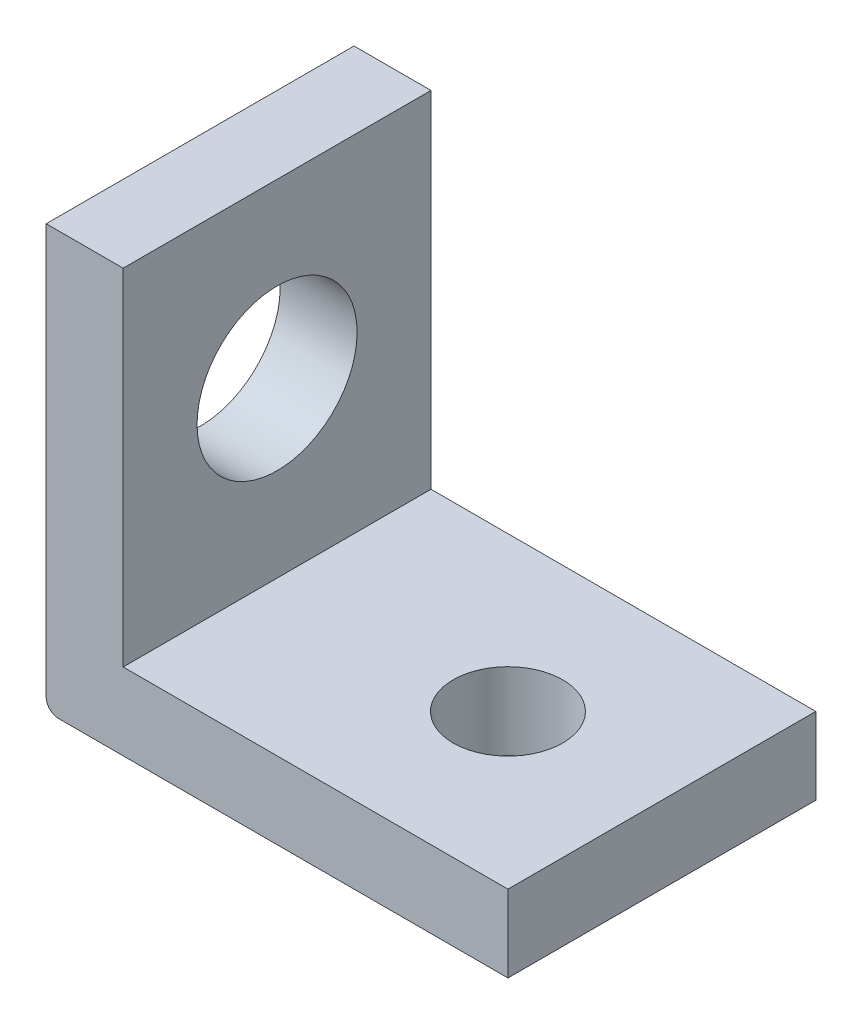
ISO-10303-21;
HEADER;
FILE_DESCRIPTION(('STEP AP214'),'2;1');
FILE_NAME('part.step','',(''),(''),'','','');
FILE_SCHEMA(('AUTOMOTIVE_DESIGN { 1 0 10303 214 1 1 1 1 }'));
ENDSEC;
DATA;
#1=APPLICATION_CONTEXT('core data for automotive mechanical design processes');
#2=APPLICATION_PROTOCOL_DEFINITION('international standard','automotive_design',2000,#1);
#3=PRODUCT_CONTEXT('',#1,'mechanical');
#4=PRODUCT('Part','Part','',(#3));
#5=PRODUCT_RELATED_PRODUCT_CATEGORY('part','',(#4));
#6=PRODUCT_DEFINITION_FORMATION('','',#4);
#7=PRODUCT_DEFINITION_CONTEXT('part definition',#1,'design');
#8=PRODUCT_DEFINITION('design','',#6,#7);
#9=PRODUCT_DEFINITION_SHAPE('','',#8);
#10=(LENGTH_UNIT() NAMED_UNIT(*) SI_UNIT(.MILLI.,.METRE.));
#11=(NAMED_UNIT(*) PLANE_ANGLE_UNIT() SI_UNIT($,.RADIAN.));
#12=(NAMED_UNIT(*) SI_UNIT($,.STERADIAN.) SOLID_ANGLE_UNIT());
#13=UNCERTAINTY_MEASURE_WITH_UNIT(LENGTH_MEASURE(1.E-05),#10,'distance_accuracy_value','');
#14=(GEOMETRIC_REPRESENTATION_CONTEXT(3) GLOBAL_UNCERTAINTY_ASSIGNED_CONTEXT((#13)) GLOBAL_UNIT_ASSIGNED_CONTEXT((#10,
#11,#12)) REPRESENTATION_CONTEXT('',''));
#15=CARTESIAN_POINT('',(0.,0.,0.));
#16=DIRECTION('',(0.,0.,1.));
#17=DIRECTION('',(1.,0.,0.));
#18=AXIS2_PLACEMENT_3D('',#15,#16,#17);
#19=CARTESIAN_POINT('',(0.,7.1247,6.35));
#20=DIRECTION('',(0.,-1.,0.));
#21=DIRECTION('',(1.,0.,0.));
#22=AXIS2_PLACEMENT_3D('',#19,#20,#21);
#23=PLANE('',#22);
#24=DIRECTION('',(-1.,0.,0.));
#25=VECTOR('',#24,1.);
#26=CARTESIAN_POINT('',(0.,7.1247,0.));
#27=LINE('',#26,#25);
#28=CARTESIAN_POINT('',(0.,7.1247,0.));
#29=VERTEX_POINT('',#28);
#30=CARTESIAN_POINT('',(-1.5875,7.1247,0.));
#31=VERTEX_POINT('',#30);
#32=EDGE_CURVE('E126',#29,#31,#27,.T.);
#33=ORIENTED_EDGE('',*,*,#32,.T.);
#34=DIRECTION('',(0.,0.,-1.));
#35=VECTOR('',#34,1.);
#36=CARTESIAN_POINT('',(-1.5875,7.1247,6.35));
#37=LINE('',#36,#35);
#38=CARTESIAN_POINT('',(-1.5875,7.1247,6.35));
#39=VERTEX_POINT('',#38);
#40=EDGE_CURVE('E11',#39,#31,#37,.T.);
#41=ORIENTED_EDGE('',*,*,#40,.F.);
#42=DIRECTION('',(-1.,0.,0.));
#43=VECTOR('',#42,1.);
#44=CARTESIAN_POINT('',(0.,7.1247,6.35));
#45=LINE('',#44,#43);
#46=CARTESIAN_POINT('',(0.,7.1247,6.35));
#47=VERTEX_POINT('',#46);
#48=EDGE_CURVE('E139',#47,#39,#45,.T.);
#49=ORIENTED_EDGE('',*,*,#48,.F.);
#50=DIRECTION('',(0.,0.,-1.));
#51=VECTOR('',#50,1.);
#52=CARTESIAN_POINT('',(0.,7.1247,6.35));
#53=LINE('',#52,#51);
#54=EDGE_CURVE('E122',#47,#29,#53,.T.);
#55=ORIENTED_EDGE('',*,*,#54,.T.);
#56=EDGE_LOOP('',(#33,#41,#49,#55));
#57=FACE_BOUND('',#56,.T.);
#58=ADVANCED_FACE('F36',(#57),#23,.F.);
#59=CARTESIAN_POINT('',(-1.5875,7.1247,6.35));
#60=DIRECTION('',(1.,0.,0.));
#61=DIRECTION('',(0.,1.,0.));
#62=AXIS2_PLACEMENT_3D('',#59,#60,#61);
#63=PLANE('',#62);
#64=CARTESIAN_POINT('',(-1.5875,3.5687,3.175));
#65=DIRECTION('',(1.,0.,0.));
#66=DIRECTION('',(0.,1.,0.));
#67=AXIS2_PLACEMENT_3D('',#64,#65,#66);
#68=CIRCLE('',#67,1.65099999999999);
#69=CARTESIAN_POINT('',(-1.5875,5.21969999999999,3.175));
#70=VERTEX_POINT('',#69);
#71=EDGE_CURVE('E130',#70,#70,#68,.T.);
#72=ORIENTED_EDGE('',*,*,#71,.T.);
#73=EDGE_LOOP('',(#72));
#74=FACE_BOUND('',#73,.T.);
#75=DIRECTION('',(0.,-1.,0.));
#76=VECTOR('',#75,1.);
#77=CARTESIAN_POINT('',(-1.5875,7.1247,0.));
#78=LINE('',#77,#76);
#79=CARTESIAN_POINT('',(-1.5875,-1.3335,0.));
#80=VERTEX_POINT('',#79);
#81=EDGE_CURVE('E129',#31,#80,#78,.T.);
#82=ORIENTED_EDGE('',*,*,#81,.T.);
#83=DIRECTION('',(0.,0.,-1.));
#84=VECTOR('',#83,1.);
#85=CARTESIAN_POINT('',(-1.5875,-1.3335,6.35));
#86=LINE('',#85,#84);
#87=CARTESIAN_POINT('',(-1.5875,-1.3335,6.35));
#88=VERTEX_POINT('',#87);
#89=EDGE_CURVE('E44',#88,#80,#86,.T.);
#90=ORIENTED_EDGE('',*,*,#89,.F.);
#91=DIRECTION('',(0.,-1.,0.));
#92=VECTOR('',#91,1.);
#93=CARTESIAN_POINT('',(-1.5875,7.1247,6.35));
#94=LINE('',#93,#92);
#95=EDGE_CURVE('E92',#39,#88,#94,.T.);
#96=ORIENTED_EDGE('',*,*,#95,.F.);
#97=ORIENTED_EDGE('',*,*,#40,.T.);
#98=EDGE_LOOP('',(#82,#90,#96,#97));
#99=FACE_BOUND('',#98,.T.);
#100=ADVANCED_FACE('F187',(#74,#99),#63,.F.);
#101=CARTESIAN_POINT('',(-1.3335,-1.3335,6.35));
#102=DIRECTION('',(0.,0.,-1.));
#103=DIRECTION('',(-1.,0.,0.));
#104=AXIS2_PLACEMENT_3D('',#101,#102,#103);
#105=CYLINDRICAL_SURFACE('',#104,0.254);
#106=CARTESIAN_POINT('',(-1.3335,-1.3335,0.));
#107=DIRECTION('',(0.,0.,1.));
#108=DIRECTION('',(1.,0.,0.));
#109=AXIS2_PLACEMENT_3D('',#106,#107,#108);
#110=CIRCLE('',#109,0.254);
#111=CARTESIAN_POINT('',(-1.3335,-1.5875,0.));
#112=VERTEX_POINT('',#111);
#113=EDGE_CURVE('E132',#80,#112,#110,.T.);
#114=ORIENTED_EDGE('',*,*,#113,.T.);
#115=DIRECTION('',(0.,0.,-1.));
#116=VECTOR('',#115,1.);
#117=CARTESIAN_POINT('',(-1.3335,-1.5875,6.35));
#118=LINE('',#117,#116);
#119=CARTESIAN_POINT('',(-1.3335,-1.5875,6.35));
#120=VERTEX_POINT('',#119);
#121=EDGE_CURVE('E143',#120,#112,#118,.T.);
#122=ORIENTED_EDGE('',*,*,#121,.F.);
#123=CARTESIAN_POINT('',(-1.3335,-1.3335,6.35));
#124=DIRECTION('',(0.,0.,1.));
#125=DIRECTION('',(1.,0.,0.));
#126=AXIS2_PLACEMENT_3D('',#123,#124,#125);
#127=CIRCLE('',#126,0.254);
#128=EDGE_CURVE('E151',#88,#120,#127,.T.);
#129=ORIENTED_EDGE('',*,*,#128,.F.);
#130=ORIENTED_EDGE('',*,*,#89,.T.);
#131=EDGE_LOOP('',(#114,#122,#129,#130));
#132=FACE_BOUND('',#131,.T.);
#133=ADVANCED_FACE('F149',(#132),#105,.T.);
#134=CARTESIAN_POINT('',(-1.3335,-1.5875,6.35));
#135=DIRECTION('',(0.,1.,0.));
#136=DIRECTION('',(-1.,0.,0.));
#137=AXIS2_PLACEMENT_3D('',#134,#135,#136);
#138=PLANE('',#137);
#139=CARTESIAN_POINT('',(4.7625,-1.5875,3.175));
#140=DIRECTION('',(0.,1.,0.));
#141=DIRECTION('',(0.,0.,1.));
#142=AXIS2_PLACEMENT_3D('',#139,#140,#141);
#143=CIRCLE('',#142,1.1303);
#144=CARTESIAN_POINT('',(4.7625,-1.5875,4.3053));
#145=VERTEX_POINT('',#144);
#146=EDGE_CURVE('E167',#145,#145,#143,.T.);
#147=ORIENTED_EDGE('',*,*,#146,.T.);
#148=EDGE_LOOP('',(#147));
#149=FACE_BOUND('',#148,.T.);
#150=DIRECTION('',(1.,0.,0.));
#151=VECTOR('',#150,1.);
#152=CARTESIAN_POINT('',(-1.3335,-1.5875,0.));
#153=LINE('',#152,#151);
#154=CARTESIAN_POINT('',(7.9375,-1.5875,0.));
#155=VERTEX_POINT('',#154);
#156=EDGE_CURVE('E134',#112,#155,#153,.T.);
#157=ORIENTED_EDGE('',*,*,#156,.T.);
#158=DIRECTION('',(0.,0.,-1.));
#159=VECTOR('',#158,1.);
#160=CARTESIAN_POINT('',(7.9375,-1.5875,6.35));
#161=LINE('',#160,#159);
#162=CARTESIAN_POINT('',(7.9375,-1.5875,6.35));
#163=VERTEX_POINT('',#162);
#164=EDGE_CURVE('E117',#163,#155,#161,.T.);
#165=ORIENTED_EDGE('',*,*,#164,.F.);
#166=DIRECTION('',(1.,0.,0.));
#167=VECTOR('',#166,1.);
#168=CARTESIAN_POINT('',(-1.3335,-1.5875,6.35));
#169=LINE('',#168,#167);
#170=EDGE_CURVE('E108',#120,#163,#169,.T.);
#171=ORIENTED_EDGE('',*,*,#170,.F.);
#172=ORIENTED_EDGE('',*,*,#121,.T.);
#173=EDGE_LOOP('',(#157,#165,#171,#172));
#174=FACE_BOUND('',#173,.T.);
#175=ADVANCED_FACE('F157',(#149,#174),#138,.F.);
#176=CARTESIAN_POINT('',(7.9375,-1.5875,6.35));
#177=DIRECTION('',(-1.,0.,0.));
#178=DIRECTION('',(0.,0.,1.));
#179=AXIS2_PLACEMENT_3D('',#176,#177,#178);
#180=PLANE('',#179);
#181=DIRECTION('',(0.,1.,0.));
#182=VECTOR('',#181,1.);
#183=CARTESIAN_POINT('',(7.9375,-1.5875,0.));
#184=LINE('',#183,#182);
#185=CARTESIAN_POINT('',(7.9375,0.,0.));
#186=VERTEX_POINT('',#185);
#187=EDGE_CURVE('E116',#155,#186,#184,.T.);
#188=ORIENTED_EDGE('',*,*,#187,.T.);
#189=DIRECTION('',(0.,0.,-1.));
#190=VECTOR('',#189,1.);
#191=CARTESIAN_POINT('',(7.9375,0.,6.35));
#192=LINE('',#191,#190);
#193=CARTESIAN_POINT('',(7.9375,0.,6.35));
#194=VERTEX_POINT('',#193);
#195=EDGE_CURVE('E113',#194,#186,#192,.T.);
#196=ORIENTED_EDGE('',*,*,#195,.F.);
#197=DIRECTION('',(0.,1.,0.));
#198=VECTOR('',#197,1.);
#199=CARTESIAN_POINT('',(7.9375,-1.5875,6.35));
#200=LINE('',#199,#198);
#201=EDGE_CURVE('E102',#163,#194,#200,.T.);
#202=ORIENTED_EDGE('',*,*,#201,.F.);
#203=ORIENTED_EDGE('',*,*,#164,.T.);
#204=EDGE_LOOP('',(#188,#196,#202,#203));
#205=FACE_BOUND('',#204,.T.);
#206=ADVANCED_FACE('F114',(#205),#180,.F.);
#207=CARTESIAN_POINT('',(7.9375,0.,6.35));
#208=DIRECTION('',(0.,-1.,0.));
#209=DIRECTION('',(1.,0.,0.));
#210=AXIS2_PLACEMENT_3D('',#207,#208,#209);
#211=PLANE('',#210);
#212=CARTESIAN_POINT('',(4.7625,0.,3.175));
#213=DIRECTION('',(0.,1.,0.));
#214=DIRECTION('',(0.,0.,1.));
#215=AXIS2_PLACEMENT_3D('',#212,#213,#214);
#216=CIRCLE('',#215,1.13029999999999);
#217=CARTESIAN_POINT('',(4.7625,0.,4.30529999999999));
#218=VERTEX_POINT('',#217);
#219=EDGE_CURVE('E170',#218,#218,#216,.T.);
#220=ORIENTED_EDGE('',*,*,#219,.F.);
#221=EDGE_LOOP('',(#220));
#222=FACE_BOUND('',#221,.T.);
#223=DIRECTION('',(-1.,0.,0.));
#224=VECTOR('',#223,1.);
#225=CARTESIAN_POINT('',(7.9375,0.,0.));
#226=LINE('',#225,#224);
#227=CARTESIAN_POINT('',(0.,0.,0.));
#228=VERTEX_POINT('',#227);
#229=EDGE_CURVE('E78',#186,#228,#226,.T.);
#230=ORIENTED_EDGE('',*,*,#229,.T.);
#231=DIRECTION('',(0.,0.,-1.));
#232=VECTOR('',#231,1.);
#233=CARTESIAN_POINT('',(0.,0.,6.35));
#234=LINE('',#233,#232);
#235=CARTESIAN_POINT('',(0.,0.,6.35));
#236=VERTEX_POINT('',#235);
#237=EDGE_CURVE('E118',#236,#228,#234,.T.);
#238=ORIENTED_EDGE('',*,*,#237,.F.);
#239=DIRECTION('',(-1.,0.,0.));
#240=VECTOR('',#239,1.);
#241=CARTESIAN_POINT('',(7.9375,0.,6.35));
#242=LINE('',#241,#240);
#243=EDGE_CURVE('E106',#194,#236,#242,.T.);
#244=ORIENTED_EDGE('',*,*,#243,.F.);
#245=ORIENTED_EDGE('',*,*,#195,.T.);
#246=EDGE_LOOP('',(#230,#238,#244,#245));
#247=FACE_BOUND('',#246,.T.);
#248=ADVANCED_FACE('F120',(#222,#247),#211,.F.);
#249=CARTESIAN_POINT('',(0.,0.,6.35));
#250=DIRECTION('',(-1.,0.,0.));
#251=DIRECTION('',(0.,-1.,0.));
#252=AXIS2_PLACEMENT_3D('',#249,#250,#251);
#253=PLANE('',#252);
#254=CARTESIAN_POINT('',(0.,3.5687,3.175));
#255=DIRECTION('',(1.,0.,0.));
#256=DIRECTION('',(0.,0.,-1.));
#257=AXIS2_PLACEMENT_3D('',#254,#255,#256);
#258=CIRCLE('',#257,1.65099999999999);
#259=CARTESIAN_POINT('',(0.,3.5687,1.52400000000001));
#260=VERTEX_POINT('',#259);
#261=EDGE_CURVE('E164',#260,#260,#258,.T.);
#262=ORIENTED_EDGE('',*,*,#261,.F.);
#263=EDGE_LOOP('',(#262));
#264=FACE_BOUND('',#263,.T.);
#265=DIRECTION('',(0.,1.,0.));
#266=VECTOR('',#265,1.);
#267=CARTESIAN_POINT('',(0.,0.,0.));
#268=LINE('',#267,#266);
#269=EDGE_CURVE('E84',#228,#29,#268,.T.);
#270=ORIENTED_EDGE('',*,*,#269,.T.);
#271=ORIENTED_EDGE('',*,*,#54,.F.);
#272=DIRECTION('',(0.,1.,0.));
#273=VECTOR('',#272,1.);
#274=CARTESIAN_POINT('',(0.,0.,6.35));
#275=LINE('',#274,#273);
#276=EDGE_CURVE('E52',#236,#47,#275,.T.);
#277=ORIENTED_EDGE('',*,*,#276,.F.);
#278=ORIENTED_EDGE('',*,*,#237,.T.);
#279=EDGE_LOOP('',(#270,#271,#277,#278));
#280=FACE_BOUND('',#279,.T.);
#281=ADVANCED_FACE('F177',(#264,#280),#253,.F.);
#282=CARTESIAN_POINT('',(-1.3335,-1.3335,6.35));
#283=DIRECTION('',(0.,0.,1.));
#284=DIRECTION('',(1.,0.,0.));
#285=AXIS2_PLACEMENT_3D('',#282,#283,#284);
#286=PLANE('',#285);
#287=ORIENTED_EDGE('',*,*,#48,.T.);
#288=ORIENTED_EDGE('',*,*,#95,.T.);
#289=ORIENTED_EDGE('',*,*,#128,.T.);
#290=ORIENTED_EDGE('',*,*,#170,.T.);
#291=ORIENTED_EDGE('',*,*,#201,.T.);
#292=ORIENTED_EDGE('',*,*,#243,.T.);
#293=ORIENTED_EDGE('',*,*,#276,.T.);
#294=EDGE_LOOP('',(#287,#288,#289,#290,#291,#292,#293));
#295=FACE_BOUND('',#294,.T.);
#296=ADVANCED_FACE('F104',(#295),#286,.T.);
#297=CARTESIAN_POINT('',(-1.3335,-1.3335,0.));
#298=DIRECTION('',(0.,0.,1.));
#299=DIRECTION('',(1.,0.,0.));
#300=AXIS2_PLACEMENT_3D('',#297,#298,#299);
#301=PLANE('',#300);
#302=ORIENTED_EDGE('',*,*,#32,.F.);
#303=ORIENTED_EDGE('',*,*,#269,.F.);
#304=ORIENTED_EDGE('',*,*,#229,.F.);
#305=ORIENTED_EDGE('',*,*,#187,.F.);
#306=ORIENTED_EDGE('',*,*,#156,.F.);
#307=ORIENTED_EDGE('',*,*,#113,.F.);
#308=ORIENTED_EDGE('',*,*,#81,.F.);
#309=EDGE_LOOP('',(#302,#303,#304,#305,#306,#307,#308));
#310=FACE_BOUND('',#309,.T.);
#311=ADVANCED_FACE('F155',(#310),#301,.F.);
#312=CARTESIAN_POINT('',(0.,3.5687,3.175));
#313=DIRECTION('',(1.,0.,0.));
#314=DIRECTION('',(0.,0.,-1.));
#315=AXIS2_PLACEMENT_3D('',#312,#313,#314);
#316=CYLINDRICAL_SURFACE('',#315,1.65099999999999);
#317=ORIENTED_EDGE('',*,*,#261,.T.);
#318=EDGE_LOOP('',(#317));
#319=FACE_BOUND('',#318,.T.);
#320=ORIENTED_EDGE('',*,*,#71,.F.);
#321=EDGE_LOOP('',(#320));
#322=FACE_BOUND('',#321,.T.);
#323=ADVANCED_FACE('F207',(#319,#322),#316,.F.);
#324=CARTESIAN_POINT('',(4.7625,0.,3.175));
#325=DIRECTION('',(0.,1.,0.));
#326=DIRECTION('',(0.,0.,1.));
#327=AXIS2_PLACEMENT_3D('',#324,#325,#326);
#328=CYLINDRICAL_SURFACE('',#327,1.13029999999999);
#329=ORIENTED_EDGE('',*,*,#146,.F.);
#330=EDGE_LOOP('',(#329));
#331=FACE_BOUND('',#330,.T.);
#332=ORIENTED_EDGE('',*,*,#219,.T.);
#333=EDGE_LOOP('',(#332));
#334=FACE_BOUND('',#333,.T.);
#335=ADVANCED_FACE('F174',(#331,#334),#328,.F.);
#336=CLOSED_SHELL('',(#58,#100,#133,#175,#206,#248,#281,#296,#311,#323,#335));
#337=MANIFOLD_SOLID_BREP('B2',#336);
#338=ADVANCED_BREP_SHAPE_REPRESENTATION('',(#18,#337),#14);
#339=SHAPE_DEFINITION_REPRESENTATION(#9,#338);
ENDSEC;
END-ISO-10303-21;
